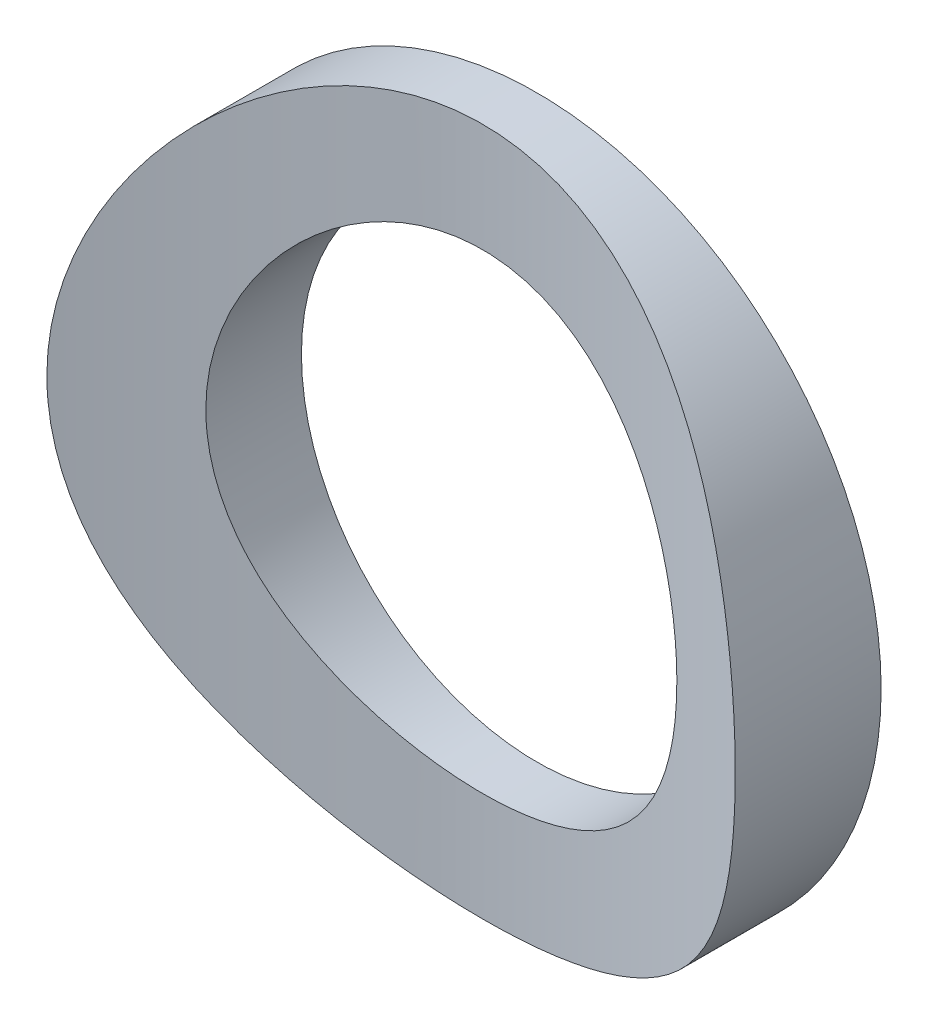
ISO-10303-21;
HEADER;
FILE_DESCRIPTION(('STEP AP214'),'2;1');
FILE_NAME('part.step','',(''),(''),'','','');
FILE_SCHEMA(('AUTOMOTIVE_DESIGN { 1 0 10303 214 1 1 1 1 }'));
ENDSEC;
DATA;
#1=APPLICATION_CONTEXT('core data for automotive mechanical design processes');
#2=APPLICATION_PROTOCOL_DEFINITION('international standard','automotive_design',2000,#1);
#3=PRODUCT_CONTEXT('',#1,'mechanical');
#4=PRODUCT('Part','Part','',(#3));
#5=PRODUCT_RELATED_PRODUCT_CATEGORY('part','',(#4));
#6=PRODUCT_DEFINITION_FORMATION('','',#4);
#7=PRODUCT_DEFINITION_CONTEXT('part definition',#1,'design');
#8=PRODUCT_DEFINITION('design','',#6,#7);
#9=PRODUCT_DEFINITION_SHAPE('','',#8);
#10=(LENGTH_UNIT() NAMED_UNIT(*) SI_UNIT(.MILLI.,.METRE.));
#11=(NAMED_UNIT(*) PLANE_ANGLE_UNIT() SI_UNIT($,.RADIAN.));
#12=(NAMED_UNIT(*) SI_UNIT($,.STERADIAN.) SOLID_ANGLE_UNIT());
#13=UNCERTAINTY_MEASURE_WITH_UNIT(LENGTH_MEASURE(1.E-05),#10,'distance_accuracy_value','');
#14=(GEOMETRIC_REPRESENTATION_CONTEXT(3) GLOBAL_UNCERTAINTY_ASSIGNED_CONTEXT((#13)) GLOBAL_UNIT_ASSIGNED_CONTEXT((#10,
#11,#12)) REPRESENTATION_CONTEXT('',''));
#15=CARTESIAN_POINT('',(0.,0.,0.));
#16=DIRECTION('',(0.,0.,1.));
#17=DIRECTION('',(1.,0.,0.));
#18=AXIS2_PLACEMENT_3D('',#15,#16,#17);
#19=CARTESIAN_POINT('',(0.,0.,0.));
#20=DIRECTION('',(0.,0.,1.));
#21=DIRECTION('',(1.,0.,0.));
#22=AXIS2_PLACEMENT_3D('',#19,#20,#21);
#23=PLANE('',#22);
#24=CARTESIAN_POINT('',(0.,0.,0.));
#25=DIRECTION('',(0.,0.,1.));
#26=DIRECTION('',(1.,0.,0.));
#27=AXIS2_PLACEMENT_3D('',#24,#25,#26);
#28=CIRCLE('',#27,19.);
#29=CARTESIAN_POINT('',(19.,0.,0.));
#30=VERTEX_POINT('',#29);
#31=EDGE_CURVE('E10',#30,#30,#28,.T.);
#32=ORIENTED_EDGE('',*,*,#31,.F.);
#33=EDGE_LOOP('',(#32));
#34=FACE_BOUND('',#33,.T.);
#35=CARTESIAN_POINT('',(0.,0.,0.));
#36=DIRECTION('',(0.,0.,1.));
#37=DIRECTION('',(1.,0.,0.));
#38=AXIS2_PLACEMENT_3D('',#35,#36,#37);
#39=CIRCLE('',#38,13.);
#40=CARTESIAN_POINT('',(13.,0.,0.));
#41=VERTEX_POINT('',#40);
#42=EDGE_CURVE('E40',#41,#41,#39,.T.);
#43=ORIENTED_EDGE('',*,*,#42,.T.);
#44=EDGE_LOOP('',(#43));
#45=FACE_BOUND('',#44,.T.);
#46=ADVANCED_FACE('F27',(#34,#45),#23,.F.);
#47=CARTESIAN_POINT('',(0.,0.,10.));
#48=DIRECTION('',(0.,0.,-1.));
#49=DIRECTION('',(-1.,0.,0.));
#50=AXIS2_PLACEMENT_3D('',#47,#48,#49);
#51=CYLINDRICAL_SURFACE('',#50,19.);
#52=CARTESIAN_POINT('',(-19.,0.,8.05267330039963));
#53=CARTESIAN_POINT('',(-18.9999976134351,0.495762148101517,8.05267016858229));
#54=CARTESIAN_POINT('',(-18.9805702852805,0.991573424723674,8.04152985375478));
#55=CARTESIAN_POINT('',(-18.9031122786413,1.97938526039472,7.99737930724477));
#56=CARTESIAN_POINT('',(-18.8450633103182,2.47138390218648,7.96435871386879));
#57=CARTESIAN_POINT('',(-18.690990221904,3.44847134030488,7.87759837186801));
#58=CARTESIAN_POINT('',(-18.5948955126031,3.93354554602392,7.8238201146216));
#59=CARTESIAN_POINT('',(-18.3659429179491,4.89234945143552,7.69747862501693));
#60=CARTESIAN_POINT('',(-18.2330886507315,5.36608026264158,7.62491724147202));
#61=CARTESIAN_POINT('',(-17.9328768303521,6.29680734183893,7.4638600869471));
#62=CARTESIAN_POINT('',(-17.7657058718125,6.75387899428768,7.37545080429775));
#63=CARTESIAN_POINT('',(-17.3979983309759,7.65146399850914,7.18513569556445));
#64=CARTESIAN_POINT('',(-17.1974610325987,8.09197699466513,7.0832295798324));
#65=CARTESIAN_POINT('',(-16.7646584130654,8.9542672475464,6.86879858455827));
#66=CARTESIAN_POINT('',(-16.5324007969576,9.37604902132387,6.75627628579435));
#67=CARTESIAN_POINT('',(-16.0375690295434,10.1993709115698,6.5234444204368));
#68=CARTESIAN_POINT('',(-15.7749837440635,10.6009035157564,6.40313200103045));
#69=CARTESIAN_POINT('',(-15.1985125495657,11.413728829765,6.14764979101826));
#70=CARTESIAN_POINT('',(-14.8821924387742,11.8231670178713,6.01206681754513));
#71=CARTESIAN_POINT('',(-14.2176388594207,12.6145050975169,5.73872952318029));
#72=CARTESIAN_POINT('',(-13.8694037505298,12.9964035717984,5.60097509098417));
#73=CARTESIAN_POINT('',(-13.1425064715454,13.7310487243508,5.32663703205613));
#74=CARTESIAN_POINT('',(-12.76382478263,14.0837764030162,5.19005421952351));
#75=CARTESIAN_POINT('',(-11.9781375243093,14.7577787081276,4.92151230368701));
#76=CARTESIAN_POINT('',(-11.5711415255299,15.0790638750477,4.78955166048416));
#77=CARTESIAN_POINT('',(-10.7025609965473,15.7086506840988,4.52484166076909));
#78=CARTESIAN_POINT('',(-10.2391461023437,16.0146588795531,4.39262619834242));
#79=CARTESIAN_POINT('',(-9.28472166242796,16.5862396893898,4.14070166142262));
#80=CARTESIAN_POINT('',(-8.79371055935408,16.8518100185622,4.02099329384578));
#81=CARTESIAN_POINT('',(-7.78745776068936,17.3397804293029,3.79758426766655));
#82=CARTESIAN_POINT('',(-7.27222781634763,17.5622011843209,3.69387594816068));
#83=CARTESIAN_POINT('',(-6.22104186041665,17.9614764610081,3.50551533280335));
#84=CARTESIAN_POINT('',(-5.68508802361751,18.1383357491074,3.42086104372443));
#85=CARTESIAN_POINT('',(-4.63509065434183,18.4334496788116,3.27844373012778));
#86=CARTESIAN_POINT('',(-4.12215892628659,18.5549522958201,3.21920767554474));
#87=CARTESIAN_POINT('',(-3.08607098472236,18.7551190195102,3.12114801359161));
#88=CARTESIAN_POINT('',(-2.56291521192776,18.8337849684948,3.08232352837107));
#89=CARTESIAN_POINT('',(-1.51097921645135,18.9472073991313,3.02622809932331));
#90=CARTESIAN_POINT('',(-0.98220195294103,18.9819859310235,3.00894633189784));
#91=CARTESIAN_POINT('',(0.0766570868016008,19.0072229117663,2.99641340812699));
#92=CARTESIAN_POINT('',(0.606738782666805,18.9976840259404,3.00116092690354));
#93=CARTESIAN_POINT('',(1.61811372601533,18.9371560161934,3.03118529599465));
#94=CARTESIAN_POINT('',(2.09968330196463,18.8898011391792,3.05466201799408));
#95=CARTESIAN_POINT('',(3.0566130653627,18.7587394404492,3.11930960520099));
#96=CARTESIAN_POINT('',(3.53197368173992,18.6750351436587,3.16047924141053));
#97=CARTESIAN_POINT('',(4.4732916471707,18.4721818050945,3.2595251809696));
#98=CARTESIAN_POINT('',(4.93924868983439,18.3530316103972,3.31740202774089));
#99=CARTESIAN_POINT('',(5.8588185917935,18.0804933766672,3.44851223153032));
#100=CARTESIAN_POINT('',(6.31243100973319,17.9271041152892,3.52174613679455));
#101=CARTESIAN_POINT('',(7.21088408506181,17.5851471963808,3.68303496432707));
#102=CARTESIAN_POINT('',(7.65551517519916,17.3961201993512,3.77128174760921));
#103=CARTESIAN_POINT('',(8.52700045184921,16.985941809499,3.95989996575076));
#104=CARTESIAN_POINT('',(8.95385465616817,16.764790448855,4.06027138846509));
#105=CARTESIAN_POINT('',(9.78784533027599,16.2919589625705,4.27101093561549));
#106=CARTESIAN_POINT('',(10.1949769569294,16.0402713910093,4.38138149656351));
#107=CARTESIAN_POINT('',(10.9876666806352,15.5080345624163,4.60980536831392));
#108=CARTESIAN_POINT('',(11.3732228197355,15.2274826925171,4.72785937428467));
#109=CARTESIAN_POINT('',(12.1562111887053,14.6115474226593,4.98054025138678));
#110=CARTESIAN_POINT('',(12.5513754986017,14.2734896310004,5.11568392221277));
#111=CARTESIAN_POINT('',(13.3121592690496,13.566725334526,5.3889858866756));
#112=CARTESIAN_POINT('',(13.677777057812,13.1980170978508,5.52714435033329));
#113=CARTESIAN_POINT('',(14.3778772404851,12.431658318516,5.80312709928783));
#114=CARTESIAN_POINT('',(14.7123442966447,12.0339936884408,5.94095118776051));
#115=CARTESIAN_POINT('',(15.3483278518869,11.2115648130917,6.21271990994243));
#116=CARTESIAN_POINT('',(15.6498287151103,10.786787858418,6.34666268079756));
#117=CARTESIAN_POINT('',(16.2355851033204,9.88496669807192,6.61506895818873));
#118=CARTESIAN_POINT('',(16.5175963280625,9.40631492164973,6.74904512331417));
#119=CARTESIAN_POINT('',(17.0397049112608,8.42364676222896,7.00390015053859));
#120=CARTESIAN_POINT('',(17.2798243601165,7.91964392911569,7.12478590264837));
#121=CARTESIAN_POINT('',(17.7157895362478,6.88937386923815,7.34906465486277));
#122=CARTESIAN_POINT('',(17.9116593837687,6.36311895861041,7.45246717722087));
#123=CARTESIAN_POINT('',(18.2568531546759,5.29186713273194,7.63767671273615));
#124=CARTESIAN_POINT('',(18.4061833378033,4.74687274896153,7.71948662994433));
#125=CARTESIAN_POINT('',(18.6462738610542,3.68624076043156,7.85245092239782));
#126=CARTESIAN_POINT('',(18.7407243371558,3.17167732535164,7.90551401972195));
#127=CARTESIAN_POINT('',(18.8869644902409,2.1346428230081,7.98812717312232));
#128=CARTESIAN_POINT('',(18.9387565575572,1.61217220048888,8.01767854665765));
#129=CARTESIAN_POINT('',(18.9988670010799,0.564228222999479,8.052006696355));
#130=CARTESIAN_POINT('',(19.0072108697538,0.0387568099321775,8.0567980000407));
#131=CARTESIAN_POINT('',(18.9803575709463,-1.01068477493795,8.041435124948));
#132=CARTESIAN_POINT('',(18.945163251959,-1.53465504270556,8.0212825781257));
#133=CARTESIAN_POINT('',(18.8379010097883,-2.52036665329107,7.960373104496));
#134=CARTESIAN_POINT('',(18.77020194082,-2.98274448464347,7.92206304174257));
#135=CARTESIAN_POINT('',(18.6013837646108,-3.89944861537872,7.82754683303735));
#136=CARTESIAN_POINT('',(18.5002675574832,-4.35377560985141,7.77134224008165));
#137=CARTESIAN_POINT('',(18.2656680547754,-5.25174252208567,7.64277266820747));
#138=CARTESIAN_POINT('',(18.1321770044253,-5.69537985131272,7.57040381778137));
#139=CARTESIAN_POINT('',(17.8340976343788,-6.56949228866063,7.41162014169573));
#140=CARTESIAN_POINT('',(17.6695074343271,-6.99996659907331,7.32520446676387));
#141=CARTESIAN_POINT('',(17.3022967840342,-7.86520607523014,7.13640200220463));
#142=CARTESIAN_POINT('',(17.0982731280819,-8.29925451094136,7.03346266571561));
#143=CARTESIAN_POINT('',(16.6591166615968,-9.14891544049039,6.81751232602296));
#144=CARTESIAN_POINT('',(16.4239705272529,-9.56451993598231,6.70449701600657));
#145=CARTESIAN_POINT('',(15.9240699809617,-10.375496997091,6.47123396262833));
#146=CARTESIAN_POINT('',(15.6593096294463,-10.7708654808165,6.35098477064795));
#147=CARTESIAN_POINT('',(15.1016257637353,-11.5397789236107,6.10606516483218));
#148=CARTESIAN_POINT('',(14.8087002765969,-11.9133223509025,5.98139444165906));
#149=CARTESIAN_POINT('',(14.1579750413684,-12.6821077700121,5.71476808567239));
#150=CARTESIAN_POINT('',(13.7966363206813,-13.074283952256,5.57258852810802));
#151=CARTESIAN_POINT('',(13.0419504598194,-13.8272078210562,5.28984967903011));
#152=CARTESIAN_POINT('',(12.648600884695,-14.1879531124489,5.14929051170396));
#153=CARTESIAN_POINT('',(11.8317074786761,-14.876019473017,4.87337163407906));
#154=CARTESIAN_POINT('',(11.4081534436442,-15.2033291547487,4.73801370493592));
#155=CARTESIAN_POINT('',(10.5331023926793,-15.8221650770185,4.47603066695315));
#156=CARTESIAN_POINT('',(10.081605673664,-16.1136916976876,4.34940546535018));
#157=CARTESIAN_POINT('',(9.1413532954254,-16.6655400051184,4.10514908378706));
#158=CARTESIAN_POINT('',(8.65194485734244,-16.9248883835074,3.98782557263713));
#159=CARTESIAN_POINT('',(7.64935490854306,-17.4010147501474,3.76916387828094));
#160=CARTESIAN_POINT('',(7.1361726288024,-17.6177913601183,3.66782621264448));
#161=CARTESIAN_POINT('',(6.09007701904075,-18.0061657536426,3.4842055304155));
#162=CARTESIAN_POINT('',(5.55717791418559,-18.1777954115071,3.40190907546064));
#163=CARTESIAN_POINT('',(4.47561630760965,-18.4738490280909,3.25883301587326));
#164=CARTESIAN_POINT('',(3.92695565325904,-18.5982784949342,3.19805090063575));
#165=CARTESIAN_POINT('',(2.86920500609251,-18.7890832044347,3.10441145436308));
#166=CARTESIAN_POINT('',(2.36105905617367,-18.8597118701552,3.06951588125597));
#167=CARTESIAN_POINT('',(1.33974344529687,-18.9596490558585,3.02005249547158));
#168=CARTESIAN_POINT('',(0.826574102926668,-18.9889601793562,3.00548340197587));
#169=CARTESIAN_POINT('',(-0.200467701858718,-19.0058814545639,2.99707879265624));
#170=CARTESIAN_POINT('',(-0.71433991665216,-18.9935037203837,3.00323725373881));
#171=CARTESIAN_POINT('',(-1.73872807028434,-18.9272354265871,3.03610320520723));
#172=CARTESIAN_POINT('',(-2.24924409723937,-18.8733459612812,3.06281015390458));
#173=CARTESIAN_POINT('',(-3.23006104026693,-18.7295568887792,3.1336625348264));
#174=CARTESIAN_POINT('',(-3.70082902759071,-18.6422090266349,3.17656969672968));
#175=CARTESIAN_POINT('',(-4.63272301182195,-18.4327408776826,3.27869405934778));
#176=CARTESIAN_POINT('',(-5.09384954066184,-18.3106225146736,3.33791035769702));
#177=CARTESIAN_POINT('',(-6.00367108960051,-18.0328092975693,3.4713039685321));
#178=CARTESIAN_POINT('',(-6.4523651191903,-17.8771117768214,3.54548246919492));
#179=CARTESIAN_POINT('',(-7.33477982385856,-17.5335452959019,3.70716120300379));
#180=CARTESIAN_POINT('',(-7.76849980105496,-17.3456748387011,3.79466205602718));
#181=CARTESIAN_POINT('',(-8.63707771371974,-16.9305186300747,3.98514403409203));
#182=CARTESIAN_POINT('',(-9.07117967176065,-16.7018834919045,4.08862967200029));
#183=CARTESIAN_POINT('',(-9.91852757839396,-16.213022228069,4.30576312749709));
#184=CARTESIAN_POINT('',(-10.3317731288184,-15.952795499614,4.41941113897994));
#185=CARTESIAN_POINT('',(-11.1356926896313,-15.4023940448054,4.65444970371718));
#186=CARTESIAN_POINT('',(-11.5263588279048,-15.112208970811,4.77584292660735));
#187=CARTESIAN_POINT('',(-12.2833534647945,-14.5036246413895,5.02376092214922));
#188=CARTESIAN_POINT('',(-12.6496797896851,-14.1852228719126,5.15028615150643));
#189=CARTESIAN_POINT('',(-13.3912803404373,-13.4891455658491,5.41835935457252));
#190=CARTESIAN_POINT('',(-13.7638870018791,-13.1087204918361,5.56016031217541));
#191=CARTESIAN_POINT('',(-14.4760269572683,-12.3177865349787,5.84302358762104));
#192=CARTESIAN_POINT('',(-14.8155578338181,-11.9072754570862,5.98408585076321));
#193=CARTESIAN_POINT('',(-15.4599278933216,-11.0578059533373,6.26176861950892));
#194=CARTESIAN_POINT('',(-15.7647351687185,-10.6188219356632,6.39838495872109));
#195=CARTESIAN_POINT('',(-16.3372865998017,-9.71489878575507,6.66307964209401));
#196=CARTESIAN_POINT('',(-16.605033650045,-9.24996168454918,6.79115865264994));
#197=CARTESIAN_POINT('',(-17.1087880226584,-8.28225100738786,7.03840885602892));
#198=CARTESIAN_POINT('',(-17.3436132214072,-7.77876310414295,7.15720137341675));
#199=CARTESIAN_POINT('',(-17.769400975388,-6.74969978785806,7.37717324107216));
#200=CARTESIAN_POINT('',(-17.9603562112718,-6.22412070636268,7.47834965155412));
#201=CARTESIAN_POINT('',(-18.2954876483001,-5.15629179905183,7.65872444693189));
#202=CARTESIAN_POINT('',(-18.4398000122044,-4.61409565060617,7.73798670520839));
#203=CARTESIAN_POINT('',(-18.6802139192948,-3.51637580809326,7.87139687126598));
#204=CARTESIAN_POINT('',(-18.7763493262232,-2.96086176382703,7.92556241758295));
#205=CARTESIAN_POINT('',(-18.8982841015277,-2.00387357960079,7.99461565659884));
#206=CARTESIAN_POINT('',(-18.9363928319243,-1.60441089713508,8.01633693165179));
#207=CARTESIAN_POINT('',(-18.9872525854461,-0.803309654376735,8.04536749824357));
#208=CARTESIAN_POINT('',(-19.0000019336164,-0.401670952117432,8.0526758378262));
#209=CARTESIAN_POINT('',(-19.,0.,8.05267330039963));
#210=B_SPLINE_CURVE_WITH_KNOTS('',3,(#52,#53,#54,#55,#56,#57,#58,#59,#60,#61,#62,#63,#64,#65,
#66,#67,#68,#69,#70,#71,#72,#73,#74,#75,#76,#77,#78,#79,#80,#81,#82,#83,#84,#85,#86,#87,#88,#89,
#90,#91,#92,#93,#94,#95,#96,#97,#98,#99,#100,#101,#102,#103,#104,#105,#106,#107,#108,#109,#110,
#111,#112,#113,#114,#115,#116,#117,#118,#119,#120,#121,#122,#123,#124,#125,#126,#127,#128,#129,
#130,#131,#132,#133,#134,#135,#136,#137,#138,#139,#140,#141,#142,#143,#144,#145,#146,#147,#148,
#149,#150,#151,#152,#153,#154,#155,#156,#157,#158,#159,#160,#161,#162,#163,#164,#165,#166,#167,
#168,#169,#170,#171,#172,#173,#174,#175,#176,#177,#178,#179,#180,#181,#182,#183,#184,#185,#186,
#187,#188,#189,#190,#191,#192,#193,#194,#195,#196,#197,#198,#199,#200,#201,#202,#203,#204,#205,
#206,#207,#208,#209),.UNSPECIFIED.,.T.,.F.,(4,2,2,2,2,2,2,2,2,2,2,2,2,2,2,2,2,2,2,2,2,2,2,2,2,2,
2,2,2,2,2,2,2,2,2,2,2,2,2,2,2,2,2,2,2,2,2,2,2,2,2,2,2,2,2,2,2,2,2,2,2,2,2,2,2,2,2,2,2,2,2,2,2,2,
2,2,2,2,4),(0.,1.48687113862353,2.97444690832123,4.46479572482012,5.95499790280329,
7.43730220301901,8.91963831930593,10.4016150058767,11.8841375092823,13.4870291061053,
15.0900031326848,16.6940131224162,18.2974835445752,20.0078503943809,21.7183138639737,
23.4279557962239,25.1374188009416,26.7265989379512,28.3157107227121,29.9040237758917,
31.4922413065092,32.9439098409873,34.3954775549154,35.8470924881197,37.2987592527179,
38.7706040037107,40.2424472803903,41.7146501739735,43.1869864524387,44.7971744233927,
46.4074534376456,48.018521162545,49.6303497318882,51.3425864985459,53.0539176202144,
54.7643136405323,56.4744795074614,58.0497823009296,59.6249968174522,61.1992870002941,
62.7734741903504,64.1784990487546,65.5834020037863,66.9886418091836,68.3939666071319,
69.8640645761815,71.3347939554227,72.8058188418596,74.2769468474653,75.9307604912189,
77.5847000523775,79.2392010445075,80.8936844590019,82.5899261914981,84.2862228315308,
85.9813186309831,87.676216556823,89.2168362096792,90.7573587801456,92.2974337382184,
93.8374680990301,95.2779947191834,96.7184416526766,98.1590030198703,99.5996314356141,
101.102324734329,102.605046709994,104.108289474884,105.611666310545,107.263000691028,
108.914455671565,110.567416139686,112.220247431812,113.922281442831,115.62459921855,
117.321901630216,119.018009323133,120.222606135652,121.427282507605),.UNSPECIFIED.);
#211=CARTESIAN_POINT('',(-19.,0.,8.05267330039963));
#212=VERTEX_POINT('',#211);
#213=EDGE_CURVE('E44',#212,#212,#210,.T.);
#214=ORIENTED_EDGE('',*,*,#213,.T.);
#215=EDGE_LOOP('',(#214));
#216=FACE_BOUND('',#215,.T.);
#217=ORIENTED_EDGE('',*,*,#31,.T.);
#218=EDGE_LOOP('',(#217));
#219=FACE_BOUND('',#218,.T.);
#220=ADVANCED_FACE('F29',(#216,#219),#51,.T.);
#221=CARTESIAN_POINT('',(0.,0.,10.));
#222=DIRECTION('',(0.,0.,-1.));
#223=DIRECTION('',(-1.,0.,0.));
#224=AXIS2_PLACEMENT_3D('',#221,#222,#223);
#225=CYLINDRICAL_SURFACE('',#224,13.);
#226=CARTESIAN_POINT('',(-13.,0.,5.27691978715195));
#227=CARTESIAN_POINT('',(-13.0000003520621,0.35359509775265,5.27692007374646));
#228=CARTESIAN_POINT('',(-12.9855615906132,0.707184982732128,5.27169222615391));
#229=CARTESIAN_POINT('',(-12.9279543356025,1.41170442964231,5.25095236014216));
#230=CARTESIAN_POINT('',(-12.88478637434,1.76263404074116,5.2354405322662));
#231=CARTESIAN_POINT('',(-12.7701423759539,2.45928860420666,5.1946307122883));
#232=CARTESIAN_POINT('',(-12.698663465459,2.80501302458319,5.16933172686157));
#233=CARTESIAN_POINT('',(-12.5280723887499,3.48877741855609,5.10974472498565));
#234=CARTESIAN_POINT('',(-12.4289598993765,3.82681730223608,5.07545660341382));
#235=CARTESIAN_POINT('',(-12.2042134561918,4.49224339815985,4.99901771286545));
#236=CARTESIAN_POINT('',(-12.0786349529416,4.81965025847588,4.9568834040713));
#237=CARTESIAN_POINT('',(-11.8018576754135,5.46247363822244,4.86593949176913));
#238=CARTESIAN_POINT('',(-11.6506589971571,5.77789020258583,4.81712991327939));
#239=CARTESIAN_POINT('',(-11.3237678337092,6.39485442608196,4.71420755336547));
#240=CARTESIAN_POINT('',(-11.1480750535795,6.69640191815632,4.66009470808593));
#241=CARTESIAN_POINT('',(-10.7733344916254,7.28400592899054,4.54801076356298));
#242=CARTESIAN_POINT('',(-10.5742783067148,7.57005681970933,4.49003827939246));
#243=CARTESIAN_POINT('',(-10.1463810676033,8.1351792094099,4.36959005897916));
#244=CARTESIAN_POINT('',(-9.91671362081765,8.41360670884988,4.30702711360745));
#245=CARTESIAN_POINT('',(-9.43513371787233,8.95032155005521,4.18110894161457));
#246=CARTESIAN_POINT('',(-9.18322067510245,9.20860836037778,4.11775369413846));
#247=CARTESIAN_POINT('',(-8.65859439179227,9.70354739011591,3.99192680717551));
#248=CARTESIAN_POINT('',(-8.38587415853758,9.94019227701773,3.9294554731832));
#249=CARTESIAN_POINT('',(-7.82143884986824,10.3901546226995,3.80709754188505));
#250=CARTESIAN_POINT('',(-7.52973042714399,10.6034801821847,3.74721005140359));
#251=CARTESIAN_POINT('',(-6.92071536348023,11.0109759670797,3.62999257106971));
#252=CARTESIAN_POINT('',(-6.60292535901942,11.2044580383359,3.57277821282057));
#253=CARTESIAN_POINT('',(-5.95112334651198,11.5638502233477,3.46434441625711));
#254=CARTESIAN_POINT('',(-5.61711095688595,11.7297596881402,3.41312511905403));
#255=CARTESIAN_POINT('',(-4.93523556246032,12.0325630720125,3.31816113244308));
#256=CARTESIAN_POINT('',(-4.58737558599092,12.1694632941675,3.27441481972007));
#257=CARTESIAN_POINT('',(-3.8802672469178,12.4130309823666,3.19566327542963));
#258=CARTESIAN_POINT('',(-3.52101939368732,12.5196997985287,3.16065765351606));
#259=CARTESIAN_POINT('',(-2.80699490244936,12.698476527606,3.10151441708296));
#260=CARTESIAN_POINT('',(-2.45252406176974,12.7716918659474,3.07703046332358));
#261=CARTESIAN_POINT('',(-1.73818080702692,12.888354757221,3.0378401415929));
#262=CARTESIAN_POINT('',(-1.37830851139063,12.9318029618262,3.02313355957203));
#263=CARTESIAN_POINT('',(-0.656003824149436,12.9884897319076,3.00391976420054));
#264=CARTESIAN_POINT('',(-0.293572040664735,13.001735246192,2.99941020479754));
#265=CARTESIAN_POINT('',(0.431108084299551,12.9979009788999,3.00071343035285));
#266=CARTESIAN_POINT('',(0.793356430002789,12.9808219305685,3.00652596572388));
#267=CARTESIAN_POINT('',(1.50011513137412,12.9178306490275,3.02785952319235));
#268=CARTESIAN_POINT('',(1.84474599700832,12.8731237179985,3.0429746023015));
#269=CARTESIAN_POINT('',(2.52881951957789,12.756389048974,3.08214782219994));
#270=CARTESIAN_POINT('',(2.86826234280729,12.684362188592,3.10620567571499));
#271=CARTESIAN_POINT('',(3.53966591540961,12.5136229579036,3.16264284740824));
#272=CARTESIAN_POINT('',(3.87162638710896,12.4149095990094,3.19502247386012));
#273=CARTESIAN_POINT('',(4.5258927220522,12.1916275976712,3.26727850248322));
#274=CARTESIAN_POINT('',(4.84819836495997,12.0670583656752,3.30715507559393));
#275=CARTESIAN_POINT('',(5.48537991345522,11.7912144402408,3.39398491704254));
#276=CARTESIAN_POINT('',(5.80009889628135,11.6396050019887,3.44102566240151));
#277=CARTESIAN_POINT('',(6.41565007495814,11.3119848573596,3.5405959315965));
#278=CARTESIAN_POINT('',(6.71648221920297,11.1359740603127,3.59312547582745));
#279=CARTESIAN_POINT('',(7.30253990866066,10.7607612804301,3.70237320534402));
#280=CARTESIAN_POINT('',(7.5877643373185,10.5615576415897,3.75909168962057));
#281=CARTESIAN_POINT('',(8.14108038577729,10.1411823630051,3.87533916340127));
#282=CARTESIAN_POINT('',(8.40916584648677,9.92000289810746,3.93486915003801));
#283=CARTESIAN_POINT('',(8.93922001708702,9.44578634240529,4.05819375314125));
#284=CARTESIAN_POINT('',(9.20025551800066,9.1917225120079,4.12205489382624));
#285=CARTESIAN_POINT('',(9.70013714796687,8.66255308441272,4.24950820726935));
#286=CARTESIAN_POINT('',(9.93898235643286,8.3874466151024,4.31310036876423));
#287=CARTESIAN_POINT('',(10.3930329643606,7.81777331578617,4.43827826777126));
#288=CARTESIAN_POINT('',(10.6082300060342,7.52319966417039,4.49986329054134));
#289=CARTESIAN_POINT('',(11.0133486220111,6.91658349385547,4.6192308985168));
#290=CARTESIAN_POINT('',(11.2032795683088,6.6045475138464,4.67701488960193));
#291=CARTESIAN_POINT('',(11.5593218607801,5.95984695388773,4.78796621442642));
#292=CARTESIAN_POINT('',(11.7250154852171,5.62693653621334,4.84104748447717));
#293=CARTESIAN_POINT('',(12.027613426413,4.94721211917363,4.93988610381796));
#294=CARTESIAN_POINT('',(12.1645172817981,4.60039789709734,4.98564333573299));
#295=CARTESIAN_POINT('',(12.4082402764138,3.89545909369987,5.0683106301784));
#296=CARTESIAN_POINT('',(12.5150702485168,3.53733863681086,5.10522387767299));
#297=CARTESIAN_POINT('',(12.6976456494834,2.81238238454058,5.16895693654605));
#298=CARTESIAN_POINT('',(12.7733927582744,2.44554706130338,5.19577729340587));
#299=CARTESIAN_POINT('',(12.8902101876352,1.7233603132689,5.23738225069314));
#300=CARTESIAN_POINT('',(12.9327347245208,1.36827262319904,5.25267043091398));
#301=CARTESIAN_POINT('',(12.9883824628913,0.655506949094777,5.27271123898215));
#302=CARTESIAN_POINT('',(13.0015065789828,0.297829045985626,5.27746419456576));
#303=CARTESIAN_POINT('',(12.9982188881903,-0.417309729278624,5.2762761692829));
#304=CARTESIAN_POINT('',(12.9818121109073,-0.774770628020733,5.270337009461));
#305=CARTESIAN_POINT('',(12.9196420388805,-1.48679363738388,5.24796619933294));
#306=CARTESIAN_POINT('',(12.8738791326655,-1.84135578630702,5.23153468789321));
#307=CARTESIAN_POINT('',(12.7556480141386,-2.53214449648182,5.18949927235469));
#308=CARTESIAN_POINT('',(12.6842088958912,-2.86856958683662,5.16424976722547));
#309=CARTESIAN_POINT('',(12.5151395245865,-3.53399546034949,5.10526609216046));
#310=CARTESIAN_POINT('',(12.4175100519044,-3.86299646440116,5.07153217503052));
#311=CARTESIAN_POINT('',(12.1968820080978,-4.51147089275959,4.99655701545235));
#312=CARTESIAN_POINT('',(12.0738845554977,-4.83094473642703,4.95531610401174));
#313=CARTESIAN_POINT('',(11.8034210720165,-5.45857789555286,4.86645967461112));
#314=CARTESIAN_POINT('',(11.6559455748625,-5.76673277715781,4.81884169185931));
#315=CARTESIAN_POINT('',(11.3324735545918,-6.37957146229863,4.71690257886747));
#316=CARTESIAN_POINT('',(11.1557108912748,-6.68382316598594,4.66241485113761));
#317=CARTESIAN_POINT('',(10.7784156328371,-7.27662430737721,4.54949543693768));
#318=CARTESIAN_POINT('',(10.5778724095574,-7.56516663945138,4.49106199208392));
#319=CARTESIAN_POINT('',(10.1543105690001,-8.12484894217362,4.37181021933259));
#320=CARTESIAN_POINT('',(9.9312860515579,-8.39598431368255,4.31099126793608));
#321=CARTESIAN_POINT('',(9.46424844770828,-8.91913166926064,4.18858142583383));
#322=CARTESIAN_POINT('',(9.2202439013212,-9.17115135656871,4.12699085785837));
#323=CARTESIAN_POINT('',(8.69965359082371,-9.66704362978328,4.00145915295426));
#324=CARTESIAN_POINT('',(8.42204214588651,-9.90985091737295,3.93755767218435));
#325=CARTESIAN_POINT('',(7.84693865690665,-10.3711811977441,3.81239039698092));
#326=CARTESIAN_POINT('',(7.54945379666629,-10.5897128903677,3.7511236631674));
#327=CARTESIAN_POINT('',(6.93631496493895,-11.001083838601,3.63288267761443));
#328=CARTESIAN_POINT('',(6.62065741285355,-11.1939180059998,3.57590927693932));
#329=CARTESIAN_POINT('',(5.97327492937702,-11.5523535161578,3.46785924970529));
#330=CARTESIAN_POINT('',(5.64155034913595,-11.7179554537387,3.41678249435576));
#331=CARTESIAN_POINT('',(4.96639429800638,-12.0195995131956,3.32226770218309));
#332=CARTESIAN_POINT('',(4.62304898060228,-12.1558199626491,3.27878390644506));
#333=CARTESIAN_POINT('',(3.92512709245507,-12.3987862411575,3.20030656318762));
#334=CARTESIAN_POINT('',(3.5705505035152,-12.5055320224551,3.16531302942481));
#335=CARTESIAN_POINT('',(2.85292211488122,-12.6884950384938,3.10484373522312));
#336=CARTESIAN_POINT('',(2.48987299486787,-12.7647217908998,3.07936500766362));
#337=CARTESIAN_POINT('',(1.75803070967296,-12.8859178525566,3.03866516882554));
#338=CARTESIAN_POINT('',(1.38923780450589,-12.930888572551,3.02344359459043));
#339=CARTESIAN_POINT('',(0.666941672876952,-12.987684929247,3.00419244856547));
#340=CARTESIAN_POINT('',(0.313569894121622,-13.0010200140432,2.99965327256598));
#341=CARTESIAN_POINT('',(-0.393068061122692,-12.9988584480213,3.0003880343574));
#342=CARTESIAN_POINT('',(-0.746334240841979,-12.9833627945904,3.00566163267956));
#343=CARTESIAN_POINT('',(-1.4501216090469,-12.9236938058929,3.02587701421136));
#344=CARTESIAN_POINT('',(-1.80064303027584,-12.8795229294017,3.04081796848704));
#345=CARTESIAN_POINT('',(-2.49642573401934,-12.7629262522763,3.07996234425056));
#346=CARTESIAN_POINT('',(-2.84168700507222,-12.6905003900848,3.10416578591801));
#347=CARTESIAN_POINT('',(-3.51866311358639,-12.5195369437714,3.16069808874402));
#348=CARTESIAN_POINT('',(-3.85050866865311,-12.4214675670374,3.19288076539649));
#349=CARTESIAN_POINT('',(-4.50459652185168,-12.1995035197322,3.26474803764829));
#350=CARTESIAN_POINT('',(-4.82683898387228,-12.0756092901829,3.30443250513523));
#351=CARTESIAN_POINT('',(-5.45971092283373,-11.802977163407,3.39031113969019));
#352=CARTESIAN_POINT('',(-5.77034090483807,-11.6542403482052,3.43650502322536));
#353=CARTESIAN_POINT('',(-6.37828483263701,-11.3329494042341,3.53428941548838));
#354=CARTESIAN_POINT('',(-6.67559359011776,-11.160386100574,3.5858820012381));
#355=CARTESIAN_POINT('',(-7.26594784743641,-10.785765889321,3.6952138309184));
#356=CARTESIAN_POINT('',(-7.55841712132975,-10.5828467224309,3.75311087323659));
#357=CARTESIAN_POINT('',(-8.12549086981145,-10.1539570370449,3.87189309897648));
#358=CARTESIAN_POINT('',(-8.40008716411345,-9.9279760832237,3.93277962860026));
#359=CARTESIAN_POINT('',(-8.92976354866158,-9.45439410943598,4.05597105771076));
#360=CARTESIAN_POINT('',(-9.18483781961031,-9.20678668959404,4.11827637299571));
#361=CARTESIAN_POINT('',(-9.67378120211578,-8.69160677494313,4.24264831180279));
#362=CARTESIAN_POINT('',(-9.90765919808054,-8.42404273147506,4.30471502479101));
#363=CARTESIAN_POINT('',(-10.3621992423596,-7.85886416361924,4.42955490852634));
#364=CARTESIAN_POINT('',(-10.5819048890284,-7.56046212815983,4.49224980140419));
#365=CARTESIAN_POINT('',(-10.9952870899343,-6.9455637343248,4.61378051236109));
#366=CARTESIAN_POINT('',(-11.1889734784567,-6.62907427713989,4.67261778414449));
#367=CARTESIAN_POINT('',(-11.5489611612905,-5.97990380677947,4.78468012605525));
#368=CARTESIAN_POINT('',(-11.7152610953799,-5.64722199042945,4.83790491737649));
#369=CARTESIAN_POINT('',(-12.0190773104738,-4.96791721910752,4.93705688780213));
#370=CARTESIAN_POINT('',(-12.1565948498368,-4.62129487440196,4.98298438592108));
#371=CARTESIAN_POINT('',(-12.3976758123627,-3.92785332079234,5.06470158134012));
#372=CARTESIAN_POINT('',(-12.5021855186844,-3.58139585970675,5.10076882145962));
#373=CARTESIAN_POINT('',(-12.6821001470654,-2.88016397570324,5.16349379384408));
#374=CARTESIAN_POINT('',(-12.7575057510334,-2.52538974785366,5.19015174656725));
#375=CARTESIAN_POINT('',(-12.8784447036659,-1.81028139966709,5.2331665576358));
#376=CARTESIAN_POINT('',(-12.9239877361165,-1.44994912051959,5.24952675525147));
#377=CARTESIAN_POINT('',(-12.9847649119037,-0.726409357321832,5.27140311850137));
#378=CARTESIAN_POINT('',(-12.9999996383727,-0.363201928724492,5.27691949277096));
#379=CARTESIAN_POINT('',(-13.,0.,5.27691978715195));
#380=B_SPLINE_CURVE_WITH_KNOTS('',3,(#226,#227,#228,#229,#230,#231,#232,#233,#234,#235,#236,
#237,#238,#239,#240,#241,#242,#243,#244,#245,#246,#247,#248,#249,#250,#251,#252,#253,#254,#255,
#256,#257,#258,#259,#260,#261,#262,#263,#264,#265,#266,#267,#268,#269,#270,#271,#272,#273,#274,
#275,#276,#277,#278,#279,#280,#281,#282,#283,#284,#285,#286,#287,#288,#289,#290,#291,#292,#293,
#294,#295,#296,#297,#298,#299,#300,#301,#302,#303,#304,#305,#306,#307,#308,#309,#310,#311,#312,
#313,#314,#315,#316,#317,#318,#319,#320,#321,#322,#323,#324,#325,#326,#327,#328,#329,#330,#331,
#332,#333,#334,#335,#336,#337,#338,#339,#340,#341,#342,#343,#344,#345,#346,#347,#348,#349,#350,
#351,#352,#353,#354,#355,#356,#357,#358,#359,#360,#361,#362,#363,#364,#365,#366,#367,#368,#369,
#370,#371,#372,#373,#374,#375,#376,#377,#378,#379),.UNSPECIFIED.,.T.,.F.,(4,2,2,2,2,2,2,2,2,2,2,
2,2,2,2,2,2,2,2,2,2,2,2,2,2,2,2,2,2,2,2,2,2,2,2,2,2,2,2,2,2,2,2,2,2,2,2,2,2,2,2,2,2,2,2,2,2,2,2,
2,2,2,2,2,2,2,2,2,2,2,2,2,2,2,2,2,4),(0.,1.06044480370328,2.1208699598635,3.18140276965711,
4.24194798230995,5.30029288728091,6.3586338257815,7.41698750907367,8.47572302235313,
9.57341155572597,10.6711290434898,11.76921708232,12.8669224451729,13.9948166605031,
15.1227374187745,16.2504128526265,17.3780379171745,18.4650065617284,19.5519514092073,
20.6386461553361,21.7253146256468,22.7676298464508,23.8099115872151,24.8522319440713,
25.8945760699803,26.9508545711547,28.0071369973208,29.0634948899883,30.1202302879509,
31.2284125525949,32.3366407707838,33.4452594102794,34.5534656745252,35.6789567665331,
36.8044658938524,37.9295690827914,39.0546114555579,40.1271140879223,41.1995833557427,
42.2718699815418,43.3441424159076,44.377513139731,45.4108530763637,46.4441474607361,
47.4778423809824,48.5448587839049,49.6123538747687,50.6801298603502,51.7474732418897,
52.8690709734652,53.9902654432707,55.1116815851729,56.2330732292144,57.3474542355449,
58.4618370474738,59.5758720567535,60.6898567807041,61.7495153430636,62.8091372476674,
63.8686683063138,64.9282016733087,65.9695977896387,67.0109761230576,68.0523091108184,
69.0940442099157,70.1747762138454,71.2559994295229,72.3375437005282,73.4186325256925,
74.5447567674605,75.6704541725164,76.7962074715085,77.9219115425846,79.0115675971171,
80.1011981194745,81.1904751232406,82.2797311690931),.UNSPECIFIED.);
#381=CARTESIAN_POINT('',(-13.,0.,5.27691978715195));
#382=VERTEX_POINT('',#381);
#383=EDGE_CURVE('E32',#382,#382,#380,.T.);
#384=ORIENTED_EDGE('',*,*,#383,.F.);
#385=EDGE_LOOP('',(#384));
#386=FACE_BOUND('',#385,.T.);
#387=ORIENTED_EDGE('',*,*,#42,.F.);
#388=EDGE_LOOP('',(#387));
#389=FACE_BOUND('',#388,.T.);
#390=ADVANCED_FACE('F53',(#386,#389),#225,.F.);
#391=CARTESIAN_POINT('',(0.,-50.,41.25));
#392=DIRECTION('',(0.,1.,0.));
#393=DIRECTION('',(0.,0.,1.));
#394=AXIS2_PLACEMENT_3D('',#391,#392,#393);
#395=CYLINDRICAL_SURFACE('',#394,38.25);
#396=ORIENTED_EDGE('',*,*,#383,.T.);
#397=EDGE_LOOP('',(#396));
#398=FACE_BOUND('',#397,.T.);
#399=ORIENTED_EDGE('',*,*,#213,.F.);
#400=EDGE_LOOP('',(#399));
#401=FACE_BOUND('',#400,.T.);
#402=ADVANCED_FACE('F50',(#398,#401),#395,.F.);
#403=CLOSED_SHELL('',(#46,#220,#390,#402));
#404=MANIFOLD_SOLID_BREP('B2',#403);
#405=ADVANCED_BREP_SHAPE_REPRESENTATION('',(#18,#404),#14);
#406=SHAPE_DEFINITION_REPRESENTATION(#9,#405);
ENDSEC;
END-ISO-10303-21;
